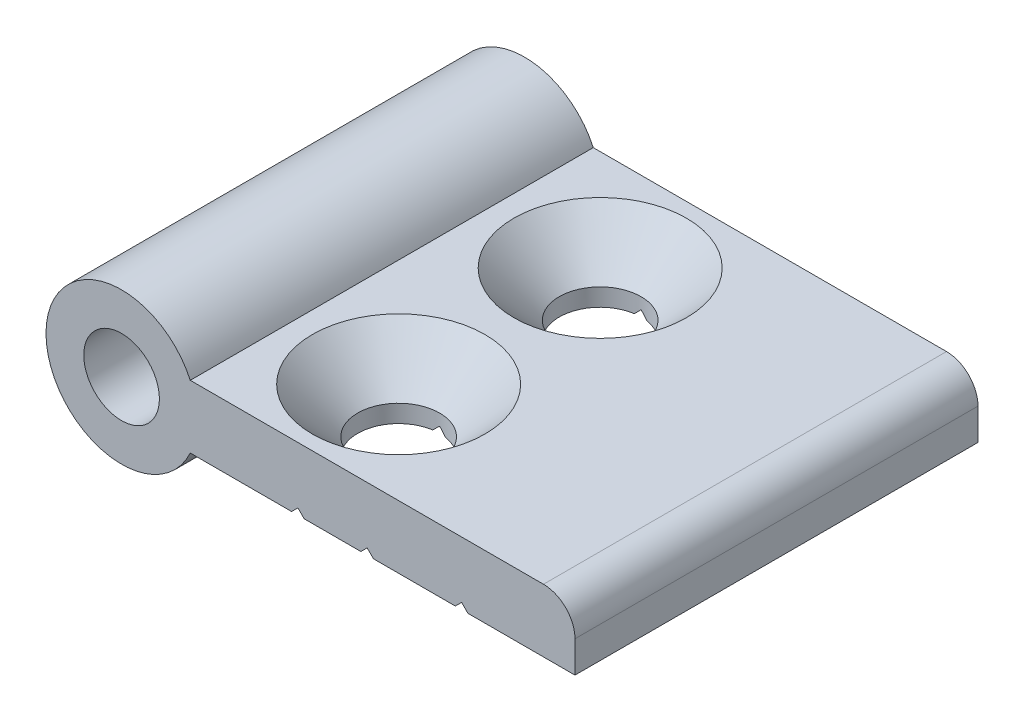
ISO-10303-21;
HEADER;
FILE_DESCRIPTION(('STEP AP214'),'2;1');
FILE_NAME('part.step','',(''),(''),'','','');
FILE_SCHEMA(('AUTOMOTIVE_DESIGN { 1 0 10303 214 1 1 1 1 }'));
ENDSEC;
DATA;
#1=APPLICATION_CONTEXT('core data for automotive mechanical design processes');
#2=APPLICATION_PROTOCOL_DEFINITION('international standard','automotive_design',2000,#1);
#3=PRODUCT_CONTEXT('',#1,'mechanical');
#4=PRODUCT('Part','Part','',(#3));
#5=PRODUCT_RELATED_PRODUCT_CATEGORY('part','',(#4));
#6=PRODUCT_DEFINITION_FORMATION('','',#4);
#7=PRODUCT_DEFINITION_CONTEXT('part definition',#1,'design');
#8=PRODUCT_DEFINITION('design','',#6,#7);
#9=PRODUCT_DEFINITION_SHAPE('','',#8);
#10=(LENGTH_UNIT() NAMED_UNIT(*) SI_UNIT(.MILLI.,.METRE.));
#11=(NAMED_UNIT(*) PLANE_ANGLE_UNIT() SI_UNIT($,.RADIAN.));
#12=(NAMED_UNIT(*) SI_UNIT($,.STERADIAN.) SOLID_ANGLE_UNIT());
#13=UNCERTAINTY_MEASURE_WITH_UNIT(LENGTH_MEASURE(1.E-05),#10,'distance_accuracy_value','');
#14=(GEOMETRIC_REPRESENTATION_CONTEXT(3) GLOBAL_UNCERTAINTY_ASSIGNED_CONTEXT((#13)) GLOBAL_UNIT_ASSIGNED_CONTEXT((#10,
#11,#12)) REPRESENTATION_CONTEXT('',''));
#15=CARTESIAN_POINT('',(0.,0.,0.));
#16=DIRECTION('',(0.,0.,1.));
#17=DIRECTION('',(1.,0.,0.));
#18=AXIS2_PLACEMENT_3D('',#15,#16,#17);
#19=CARTESIAN_POINT('',(14.,-2.,0.));
#20=DIRECTION('',(-0.707106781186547,-0.707106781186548,0.));
#21=DIRECTION('',(0.707106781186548,-0.707106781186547,0.));
#22=AXIS2_PLACEMENT_3D('',#19,#20,#21);
#23=PLANE('',#22);
#24=DIRECTION('',(0.707106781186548,-0.707106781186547,0.));
#25=VECTOR('',#24,1.);
#26=CARTESIAN_POINT('',(14.,-2.,-16.));
#27=LINE('',#26,#25);
#28=CARTESIAN_POINT('',(14.,-2.,-16.));
#29=VERTEX_POINT('',#28);
#30=CARTESIAN_POINT('',(14.5,-2.5,-16.));
#31=VERTEX_POINT('',#30);
#32=EDGE_CURVE('E133',#29,#31,#27,.T.);
#33=ORIENTED_EDGE('',*,*,#32,.T.);
#34=DIRECTION('',(0.,0.,-1.));
#35=VECTOR('',#34,1.);
#36=CARTESIAN_POINT('',(14.5,-2.5,0.));
#37=LINE('',#36,#35);
#38=CARTESIAN_POINT('',(14.5,-2.5,-11.2113081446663));
#39=VERTEX_POINT('',#38);
#40=EDGE_CURVE('E267',#39,#31,#37,.T.);
#41=ORIENTED_EDGE('',*,*,#40,.F.);
#42=CARTESIAN_POINT('',(14.,-2.,-8.));
#43=DIRECTION('',(-0.707106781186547,-0.707106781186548,0.));
#44=DIRECTION('',(0.707106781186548,-0.707106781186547,0.));
#45=AXIS2_PLACEMENT_3D('',#42,#43,#44);
#46=ELLIPSE('',#45,4.59619407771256,3.25);
#47=CARTESIAN_POINT('',(14.,-2.,-11.25));
#48=VERTEX_POINT('',#47);
#49=EDGE_CURVE('E149',#39,#48,#46,.F.);
#50=ORIENTED_EDGE('',*,*,#49,.T.);
#51=DIRECTION('',(0.,0.,1.));
#52=VECTOR('',#51,1.);
#53=CARTESIAN_POINT('',(14.,-2.,0.));
#54=LINE('',#53,#52);
#55=EDGE_CURVE('E148',#29,#48,#54,.T.);
#56=ORIENTED_EDGE('',*,*,#55,.F.);
#57=EDGE_LOOP('',(#33,#41,#50,#56));
#58=FACE_BOUND('',#57,.T.);
#59=ADVANCED_FACE('F16',(#58),#23,.T.);
#60=CARTESIAN_POINT('',(19.,-2.5,0.));
#61=DIRECTION('',(0.707106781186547,-0.707106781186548,0.));
#62=DIRECTION('',(0.707106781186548,0.707106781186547,0.));
#63=AXIS2_PLACEMENT_3D('',#60,#61,#62);
#64=PLANE('',#63);
#65=DIRECTION('',(0.707106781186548,0.707106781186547,0.));
#66=VECTOR('',#65,1.);
#67=CARTESIAN_POINT('',(19.,-2.5,16.));
#68=LINE('',#67,#66);
#69=CARTESIAN_POINT('',(19.5,-2.,16.));
#70=VERTEX_POINT('',#69);
#71=CARTESIAN_POINT('',(19.,-2.5,16.));
#72=VERTEX_POINT('',#71);
#73=EDGE_CURVE('E204',#70,#72,#68,.F.);
#74=ORIENTED_EDGE('',*,*,#73,.T.);
#75=DIRECTION('',(0.,0.,-1.));
#76=VECTOR('',#75,1.);
#77=CARTESIAN_POINT('',(19.,-2.5,0.));
#78=LINE('',#77,#76);
#79=CARTESIAN_POINT('',(19.,-2.5,-16.));
#80=VERTEX_POINT('',#79);
#81=EDGE_CURVE('E291',#80,#72,#78,.F.);
#82=ORIENTED_EDGE('',*,*,#81,.F.);
#83=DIRECTION('',(0.707106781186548,0.707106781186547,0.));
#84=VECTOR('',#83,1.);
#85=CARTESIAN_POINT('',(19.,-2.5,-16.));
#86=LINE('',#85,#84);
#87=CARTESIAN_POINT('',(19.5,-2.,-16.));
#88=VERTEX_POINT('',#87);
#89=EDGE_CURVE('E145',#80,#88,#86,.T.);
#90=ORIENTED_EDGE('',*,*,#89,.T.);
#91=DIRECTION('',(0.,0.,1.));
#92=VECTOR('',#91,1.);
#93=CARTESIAN_POINT('',(19.5,-2.,0.));
#94=LINE('',#93,#92);
#95=EDGE_CURVE('E192',#70,#88,#94,.F.);
#96=ORIENTED_EDGE('',*,*,#95,.F.);
#97=EDGE_LOOP('',(#74,#82,#90,#96));
#98=FACE_BOUND('',#97,.T.);
#99=ADVANCED_FACE('F431',(#98),#64,.T.);
#100=CARTESIAN_POINT('',(14.,-2.,0.));
#101=DIRECTION('',(-0.707106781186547,-0.707106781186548,0.));
#102=DIRECTION('',(0.707106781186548,-0.707106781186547,0.));
#103=AXIS2_PLACEMENT_3D('',#100,#101,#102);
#104=PLANE('',#103);
#105=DIRECTION('',(0.707106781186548,-0.707106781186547,0.));
#106=VECTOR('',#105,1.);
#107=CARTESIAN_POINT('',(14.,-2.,16.));
#108=LINE('',#107,#106);
#109=CARTESIAN_POINT('',(14.5,-2.5,16.));
#110=VERTEX_POINT('',#109);
#111=CARTESIAN_POINT('',(14.,-2.,16.));
#112=VERTEX_POINT('',#111);
#113=EDGE_CURVE('E201',#110,#112,#108,.F.);
#114=ORIENTED_EDGE('',*,*,#113,.T.);
#115=DIRECTION('',(0.,0.,1.));
#116=VECTOR('',#115,1.);
#117=CARTESIAN_POINT('',(14.,-2.,0.));
#118=LINE('',#117,#116);
#119=CARTESIAN_POINT('',(14.,-2.,11.25));
#120=VERTEX_POINT('',#119);
#121=EDGE_CURVE('E169',#120,#112,#118,.T.);
#122=ORIENTED_EDGE('',*,*,#121,.F.);
#123=CARTESIAN_POINT('',(14.,-2.,8.));
#124=DIRECTION('',(-0.707106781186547,-0.707106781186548,0.));
#125=DIRECTION('',(0.707106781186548,-0.707106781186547,0.));
#126=AXIS2_PLACEMENT_3D('',#123,#124,#125);
#127=ELLIPSE('',#126,4.59619407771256,3.25);
#128=CARTESIAN_POINT('',(14.5,-2.5,11.2113081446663));
#129=VERTEX_POINT('',#128);
#130=EDGE_CURVE('E179',#120,#129,#127,.F.);
#131=ORIENTED_EDGE('',*,*,#130,.T.);
#132=DIRECTION('',(0.,0.,-1.));
#133=VECTOR('',#132,1.);
#134=CARTESIAN_POINT('',(14.5,-2.5,0.));
#135=LINE('',#134,#133);
#136=EDGE_CURVE('E264',#110,#129,#135,.T.);
#137=ORIENTED_EDGE('',*,*,#136,.F.);
#138=EDGE_LOOP('',(#114,#122,#131,#137));
#139=FACE_BOUND('',#138,.T.);
#140=ADVANCED_FACE('F434',(#139),#104,.T.);
#141=CARTESIAN_POINT('',(14.,-2.,0.));
#142=DIRECTION('',(-0.707106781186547,-0.707106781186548,0.));
#143=DIRECTION('',(0.707106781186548,-0.707106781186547,0.));
#144=AXIS2_PLACEMENT_3D('',#141,#142,#143);
#145=PLANE('',#144);
#146=CARTESIAN_POINT('',(14.,-2.,8.));
#147=DIRECTION('',(-0.707106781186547,-0.707106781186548,0.));
#148=DIRECTION('',(0.707106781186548,-0.707106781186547,0.));
#149=AXIS2_PLACEMENT_3D('',#146,#147,#148);
#150=ELLIPSE('',#149,4.59619407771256,3.25);
#151=CARTESIAN_POINT('',(14.5,-2.5,4.78869185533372));
#152=VERTEX_POINT('',#151);
#153=CARTESIAN_POINT('',(14.,-2.,4.75));
#154=VERTEX_POINT('',#153);
#155=EDGE_CURVE('E273',#152,#154,#150,.F.);
#156=ORIENTED_EDGE('',*,*,#155,.T.);
#157=DIRECTION('',(0.,0.,1.));
#158=VECTOR('',#157,1.);
#159=CARTESIAN_POINT('',(14.,-2.,0.));
#160=LINE('',#159,#158);
#161=CARTESIAN_POINT('',(14.,-2.,-4.75));
#162=VERTEX_POINT('',#161);
#163=EDGE_CURVE('E176',#162,#154,#160,.T.);
#164=ORIENTED_EDGE('',*,*,#163,.F.);
#165=CARTESIAN_POINT('',(14.,-2.,-8.));
#166=DIRECTION('',(-0.707106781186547,-0.707106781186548,0.));
#167=DIRECTION('',(0.707106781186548,-0.707106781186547,0.));
#168=AXIS2_PLACEMENT_3D('',#165,#166,#167);
#169=ELLIPSE('',#168,4.59619407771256,3.25);
#170=CARTESIAN_POINT('',(14.5,-2.5,-4.78869185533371));
#171=VERTEX_POINT('',#170);
#172=EDGE_CURVE('E20',#162,#171,#169,.F.);
#173=ORIENTED_EDGE('',*,*,#172,.T.);
#174=DIRECTION('',(0.,0.,-1.));
#175=VECTOR('',#174,1.);
#176=CARTESIAN_POINT('',(14.5,-2.5,0.));
#177=LINE('',#176,#175);
#178=EDGE_CURVE('E223',#152,#171,#177,.T.);
#179=ORIENTED_EDGE('',*,*,#178,.F.);
#180=EDGE_LOOP('',(#156,#164,#173,#179));
#181=FACE_BOUND('',#180,.T.);
#182=ADVANCED_FACE('F279',(#181),#145,.T.);
#183=CARTESIAN_POINT('',(26.5,-2.5,0.));
#184=DIRECTION('',(0.707106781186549,-0.707106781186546,0.));
#185=DIRECTION('',(0.707106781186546,0.707106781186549,0.));
#186=AXIS2_PLACEMENT_3D('',#183,#184,#185);
#187=PLANE('',#186);
#188=DIRECTION('',(0.707106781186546,0.707106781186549,0.));
#189=VECTOR('',#188,1.);
#190=CARTESIAN_POINT('',(26.5,-2.5,16.));
#191=LINE('',#190,#189);
#192=CARTESIAN_POINT('',(27.,-2.,16.));
#193=VERTEX_POINT('',#192);
#194=CARTESIAN_POINT('',(26.5,-2.5,16.));
#195=VERTEX_POINT('',#194);
#196=EDGE_CURVE('E105',#193,#195,#191,.F.);
#197=ORIENTED_EDGE('',*,*,#196,.T.);
#198=DIRECTION('',(0.,0.,-1.));
#199=VECTOR('',#198,1.);
#200=CARTESIAN_POINT('',(26.5,-2.5,0.));
#201=LINE('',#200,#199);
#202=CARTESIAN_POINT('',(26.5,-2.5,-16.));
#203=VERTEX_POINT('',#202);
#204=EDGE_CURVE('E219',#203,#195,#201,.F.);
#205=ORIENTED_EDGE('',*,*,#204,.F.);
#206=DIRECTION('',(0.707106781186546,0.707106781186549,0.));
#207=VECTOR('',#206,1.);
#208=CARTESIAN_POINT('',(26.5,-2.5,-16.));
#209=LINE('',#208,#207);
#210=CARTESIAN_POINT('',(27.,-2.,-16.));
#211=VERTEX_POINT('',#210);
#212=EDGE_CURVE('E203',#203,#211,#209,.T.);
#213=ORIENTED_EDGE('',*,*,#212,.T.);
#214=DIRECTION('',(0.,0.,1.));
#215=VECTOR('',#214,1.);
#216=CARTESIAN_POINT('',(27.,-2.,0.));
#217=LINE('',#216,#215);
#218=EDGE_CURVE('E188',#193,#211,#217,.F.);
#219=ORIENTED_EDGE('',*,*,#218,.F.);
#220=EDGE_LOOP('',(#197,#205,#213,#219));
#221=FACE_BOUND('',#220,.T.);
#222=ADVANCED_FACE('F441',(#221),#187,.T.);
#223=CARTESIAN_POINT('',(19.5,-2.,0.));
#224=DIRECTION('',(-0.707106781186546,-0.707106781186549,0.));
#225=DIRECTION('',(0.707106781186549,-0.707106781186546,0.));
#226=AXIS2_PLACEMENT_3D('',#223,#224,#225);
#227=PLANE('',#226);
#228=DIRECTION('',(0.707106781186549,-0.707106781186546,0.));
#229=VECTOR('',#228,1.);
#230=CARTESIAN_POINT('',(19.5,-2.,16.));
#231=LINE('',#230,#229);
#232=CARTESIAN_POINT('',(20.,-2.5,16.));
#233=VERTEX_POINT('',#232);
#234=EDGE_CURVE('E195',#233,#70,#231,.F.);
#235=ORIENTED_EDGE('',*,*,#234,.T.);
#236=ORIENTED_EDGE('',*,*,#95,.T.);
#237=DIRECTION('',(0.707106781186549,-0.707106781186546,0.));
#238=VECTOR('',#237,1.);
#239=CARTESIAN_POINT('',(19.5,-2.,-16.));
#240=LINE('',#239,#238);
#241=CARTESIAN_POINT('',(20.,-2.5,-16.));
#242=VERTEX_POINT('',#241);
#243=EDGE_CURVE('E198',#88,#242,#240,.T.);
#244=ORIENTED_EDGE('',*,*,#243,.T.);
#245=DIRECTION('',(0.,0.,-1.));
#246=VECTOR('',#245,1.);
#247=CARTESIAN_POINT('',(20.,-2.5,0.));
#248=LINE('',#247,#246);
#249=EDGE_CURVE('E222',#233,#242,#248,.T.);
#250=ORIENTED_EDGE('',*,*,#249,.F.);
#251=EDGE_LOOP('',(#235,#236,#244,#250));
#252=FACE_BOUND('',#251,.T.);
#253=ADVANCED_FACE('F444',(#252),#227,.T.);
#254=CARTESIAN_POINT('',(27.,-2.,0.));
#255=DIRECTION('',(-0.707106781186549,-0.707106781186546,0.));
#256=DIRECTION('',(0.707106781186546,-0.707106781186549,0.));
#257=AXIS2_PLACEMENT_3D('',#254,#255,#256);
#258=PLANE('',#257);
#259=DIRECTION('',(0.707106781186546,-0.707106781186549,0.));
#260=VECTOR('',#259,1.);
#261=CARTESIAN_POINT('',(27.,-2.,16.));
#262=LINE('',#261,#260);
#263=CARTESIAN_POINT('',(27.5,-2.5,16.));
#264=VERTEX_POINT('',#263);
#265=EDGE_CURVE('E185',#264,#193,#262,.F.);
#266=ORIENTED_EDGE('',*,*,#265,.T.);
#267=ORIENTED_EDGE('',*,*,#218,.T.);
#268=DIRECTION('',(0.707106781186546,-0.707106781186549,0.));
#269=VECTOR('',#268,1.);
#270=CARTESIAN_POINT('',(27.,-2.,-16.));
#271=LINE('',#270,#269);
#272=CARTESIAN_POINT('',(27.5,-2.5,-16.));
#273=VERTEX_POINT('',#272);
#274=EDGE_CURVE('E189',#211,#273,#271,.T.);
#275=ORIENTED_EDGE('',*,*,#274,.T.);
#276=DIRECTION('',(0.,0.,-1.));
#277=VECTOR('',#276,1.);
#278=CARTESIAN_POINT('',(27.5,-2.5,0.));
#279=LINE('',#278,#277);
#280=EDGE_CURVE('E314',#264,#273,#279,.T.);
#281=ORIENTED_EDGE('',*,*,#280,.F.);
#282=EDGE_LOOP('',(#266,#267,#275,#281));
#283=FACE_BOUND('',#282,.T.);
#284=ADVANCED_FACE('F313',(#283),#258,.T.);
#285=CARTESIAN_POINT('',(14.,-1.09999999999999,-8.));
#286=DIRECTION('',(0.,-1.,0.));
#287=DIRECTION('',(0.,0.,-1.));
#288=AXIS2_PLACEMENT_3D('',#285,#286,#287);
#289=CYLINDRICAL_SURFACE('',#288,3.25);
#290=CARTESIAN_POINT('',(14.,-1.1,-8.));
#291=DIRECTION('',(0.,1.,0.));
#292=DIRECTION('',(0.,0.,1.));
#293=AXIS2_PLACEMENT_3D('',#290,#291,#292);
#294=CIRCLE('',#293,3.25);
#295=CARTESIAN_POINT('',(14.,-1.1,-4.75));
#296=VERTEX_POINT('',#295);
#297=EDGE_CURVE('E165',#296,#296,#294,.T.);
#298=ORIENTED_EDGE('',*,*,#297,.T.);
#299=EDGE_LOOP('',(#298));
#300=FACE_BOUND('',#299,.T.);
#301=CARTESIAN_POINT('',(14.,-2.,-8.));
#302=DIRECTION('',(0.707106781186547,-0.707106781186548,0.));
#303=DIRECTION('',(-0.707106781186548,-0.707106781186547,0.));
#304=AXIS2_PLACEMENT_3D('',#301,#302,#303);
#305=ELLIPSE('',#304,4.59619407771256,3.25);
#306=CARTESIAN_POINT('',(13.5,-2.5,-11.2113081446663));
#307=VERTEX_POINT('',#306);
#308=EDGE_CURVE('E154',#48,#307,#305,.F.);
#309=ORIENTED_EDGE('',*,*,#308,.F.);
#310=ORIENTED_EDGE('',*,*,#49,.F.);
#311=CARTESIAN_POINT('',(14.,-2.5,-8.));
#312=DIRECTION('',(0.,-1.,0.));
#313=DIRECTION('',(0.,0.,-1.));
#314=AXIS2_PLACEMENT_3D('',#311,#312,#313);
#315=CIRCLE('',#314,3.25);
#316=EDGE_CURVE('E153',#171,#39,#315,.F.);
#317=ORIENTED_EDGE('',*,*,#316,.F.);
#318=ORIENTED_EDGE('',*,*,#172,.F.);
#319=CARTESIAN_POINT('',(14.,-2.,-8.));
#320=DIRECTION('',(0.707106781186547,-0.707106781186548,0.));
#321=DIRECTION('',(-0.707106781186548,-0.707106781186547,0.));
#322=AXIS2_PLACEMENT_3D('',#319,#320,#321);
#323=ELLIPSE('',#322,4.59619407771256,3.25);
#324=CARTESIAN_POINT('',(13.5,-2.5,-4.78869185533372));
#325=VERTEX_POINT('',#324);
#326=EDGE_CURVE('E180',#325,#162,#323,.F.);
#327=ORIENTED_EDGE('',*,*,#326,.F.);
#328=CARTESIAN_POINT('',(14.,-2.5,-8.));
#329=DIRECTION('',(0.,-1.,0.));
#330=DIRECTION('',(0.,0.,-1.));
#331=AXIS2_PLACEMENT_3D('',#328,#329,#330);
#332=CIRCLE('',#331,3.25);
#333=EDGE_CURVE('E253',#307,#325,#332,.F.);
#334=ORIENTED_EDGE('',*,*,#333,.F.);
#335=EDGE_LOOP('',(#309,#310,#317,#318,#327,#334));
#336=FACE_BOUND('',#335,.T.);
#337=ADVANCED_FACE('F281',(#300,#336),#289,.F.);
#338=CARTESIAN_POINT('',(13.5,-2.5,0.));
#339=DIRECTION('',(0.707106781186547,-0.707106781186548,0.));
#340=DIRECTION('',(0.707106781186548,0.707106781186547,0.));
#341=AXIS2_PLACEMENT_3D('',#338,#339,#340);
#342=PLANE('',#341);
#343=CARTESIAN_POINT('',(14.,-2.,8.));
#344=DIRECTION('',(0.707106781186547,-0.707106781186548,0.));
#345=DIRECTION('',(-0.707106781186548,-0.707106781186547,0.));
#346=AXIS2_PLACEMENT_3D('',#343,#344,#345);
#347=ELLIPSE('',#346,4.59619407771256,3.25);
#348=CARTESIAN_POINT('',(13.5,-2.5,4.78869185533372));
#349=VERTEX_POINT('',#348);
#350=EDGE_CURVE('E271',#154,#349,#347,.F.);
#351=ORIENTED_EDGE('',*,*,#350,.T.);
#352=DIRECTION('',(0.,0.,-1.));
#353=VECTOR('',#352,1.);
#354=CARTESIAN_POINT('',(13.5,-2.5,0.));
#355=LINE('',#354,#353);
#356=EDGE_CURVE('E252',#325,#349,#355,.F.);
#357=ORIENTED_EDGE('',*,*,#356,.F.);
#358=ORIENTED_EDGE('',*,*,#326,.T.);
#359=ORIENTED_EDGE('',*,*,#163,.T.);
#360=EDGE_LOOP('',(#351,#357,#358,#359));
#361=FACE_BOUND('',#360,.T.);
#362=ADVANCED_FACE('F362',(#361),#342,.T.);
#363=CARTESIAN_POINT('',(14.,-1.09999999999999,8.));
#364=DIRECTION('',(0.,-1.,0.));
#365=DIRECTION('',(0.,0.,-1.));
#366=AXIS2_PLACEMENT_3D('',#363,#364,#365);
#367=CYLINDRICAL_SURFACE('',#366,3.25);
#368=CARTESIAN_POINT('',(14.,-1.1,8.));
#369=DIRECTION('',(0.,1.,0.));
#370=DIRECTION('',(0.,0.,1.));
#371=AXIS2_PLACEMENT_3D('',#368,#369,#370);
#372=CIRCLE('',#371,3.25);
#373=CARTESIAN_POINT('',(14.,-1.1,11.25));
#374=VERTEX_POINT('',#373);
#375=EDGE_CURVE('E160',#374,#374,#372,.T.);
#376=ORIENTED_EDGE('',*,*,#375,.T.);
#377=EDGE_LOOP('',(#376));
#378=FACE_BOUND('',#377,.T.);
#379=ORIENTED_EDGE('',*,*,#350,.F.);
#380=ORIENTED_EDGE('',*,*,#155,.F.);
#381=CARTESIAN_POINT('',(14.,-2.5,8.));
#382=DIRECTION('',(0.,-1.,0.));
#383=DIRECTION('',(0.,0.,-1.));
#384=AXIS2_PLACEMENT_3D('',#381,#382,#383);
#385=CIRCLE('',#384,3.25);
#386=EDGE_CURVE('E261',#129,#152,#385,.F.);
#387=ORIENTED_EDGE('',*,*,#386,.F.);
#388=ORIENTED_EDGE('',*,*,#130,.F.);
#389=CARTESIAN_POINT('',(14.,-2.,8.));
#390=DIRECTION('',(0.707106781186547,-0.707106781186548,0.));
#391=DIRECTION('',(-0.707106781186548,-0.707106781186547,0.));
#392=AXIS2_PLACEMENT_3D('',#389,#390,#391);
#393=ELLIPSE('',#392,4.59619407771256,3.25);
#394=CARTESIAN_POINT('',(13.5,-2.5,11.2113081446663));
#395=VERTEX_POINT('',#394);
#396=EDGE_CURVE('E173',#395,#120,#393,.F.);
#397=ORIENTED_EDGE('',*,*,#396,.F.);
#398=CARTESIAN_POINT('',(14.,-2.5,8.));
#399=DIRECTION('',(0.,-1.,0.));
#400=DIRECTION('',(0.,0.,-1.));
#401=AXIS2_PLACEMENT_3D('',#398,#399,#400);
#402=CIRCLE('',#401,3.25);
#403=EDGE_CURVE('E248',#349,#395,#402,.F.);
#404=ORIENTED_EDGE('',*,*,#403,.F.);
#405=EDGE_LOOP('',(#379,#380,#387,#388,#397,#404));
#406=FACE_BOUND('',#405,.T.);
#407=ADVANCED_FACE('F365',(#378,#406),#367,.F.);
#408=CARTESIAN_POINT('',(13.5,-2.5,0.));
#409=DIRECTION('',(0.707106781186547,-0.707106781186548,0.));
#410=DIRECTION('',(0.707106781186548,0.707106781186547,0.));
#411=AXIS2_PLACEMENT_3D('',#408,#409,#410);
#412=PLANE('',#411);
#413=DIRECTION('',(0.707106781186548,0.707106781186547,0.));
#414=VECTOR('',#413,1.);
#415=CARTESIAN_POINT('',(13.5,-2.5,16.));
#416=LINE('',#415,#414);
#417=CARTESIAN_POINT('',(13.5,-2.5,16.));
#418=VERTEX_POINT('',#417);
#419=EDGE_CURVE('E172',#112,#418,#416,.F.);
#420=ORIENTED_EDGE('',*,*,#419,.T.);
#421=DIRECTION('',(0.,0.,-1.));
#422=VECTOR('',#421,1.);
#423=CARTESIAN_POINT('',(13.5,-2.5,0.));
#424=LINE('',#423,#422);
#425=EDGE_CURVE('E251',#395,#418,#424,.F.);
#426=ORIENTED_EDGE('',*,*,#425,.F.);
#427=ORIENTED_EDGE('',*,*,#396,.T.);
#428=ORIENTED_EDGE('',*,*,#121,.T.);
#429=EDGE_LOOP('',(#420,#426,#427,#428));
#430=FACE_BOUND('',#429,.T.);
#431=ADVANCED_FACE('F369',(#430),#412,.T.);
#432=CARTESIAN_POINT('',(13.5,-2.5,0.));
#433=DIRECTION('',(0.707106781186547,-0.707106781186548,0.));
#434=DIRECTION('',(0.707106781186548,0.707106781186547,0.));
#435=AXIS2_PLACEMENT_3D('',#432,#433,#434);
#436=PLANE('',#435);
#437=DIRECTION('',(0.707106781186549,0.707106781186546,0.));
#438=VECTOR('',#437,1.);
#439=CARTESIAN_POINT('',(13.5,-2.5,-16.));
#440=LINE('',#439,#438);
#441=CARTESIAN_POINT('',(13.5,-2.5,-16.));
#442=VERTEX_POINT('',#441);
#443=EDGE_CURVE('E137',#442,#29,#440,.T.);
#444=ORIENTED_EDGE('',*,*,#443,.T.);
#445=ORIENTED_EDGE('',*,*,#55,.T.);
#446=ORIENTED_EDGE('',*,*,#308,.T.);
#447=DIRECTION('',(0.,0.,-1.));
#448=VECTOR('',#447,1.);
#449=CARTESIAN_POINT('',(13.5,-2.5,0.));
#450=LINE('',#449,#448);
#451=EDGE_CURVE('E158',#442,#307,#450,.F.);
#452=ORIENTED_EDGE('',*,*,#451,.F.);
#453=EDGE_LOOP('',(#444,#445,#446,#452));
#454=FACE_BOUND('',#453,.T.);
#455=ADVANCED_FACE('F156',(#454),#436,.T.);
#456=CARTESIAN_POINT('',(14.5,-2.5,0.));
#457=DIRECTION('',(0.,-1.,0.));
#458=DIRECTION('',(0.,0.,-1.));
#459=AXIS2_PLACEMENT_3D('',#456,#457,#458);
#460=PLANE('',#459);
#461=ORIENTED_EDGE('',*,*,#386,.T.);
#462=ORIENTED_EDGE('',*,*,#178,.T.);
#463=ORIENTED_EDGE('',*,*,#316,.T.);
#464=ORIENTED_EDGE('',*,*,#40,.T.);
#465=DIRECTION('',(1.,0.,0.));
#466=VECTOR('',#465,1.);
#467=CARTESIAN_POINT('',(14.3886766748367,-2.5,-16.));
#468=LINE('',#467,#466);
#469=EDGE_CURVE('E141',#31,#80,#468,.T.);
#470=ORIENTED_EDGE('',*,*,#469,.T.);
#471=ORIENTED_EDGE('',*,*,#81,.T.);
#472=DIRECTION('',(1.,0.,0.));
#473=VECTOR('',#472,1.);
#474=CARTESIAN_POINT('',(14.3886766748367,-2.5,16.));
#475=LINE('',#474,#473);
#476=EDGE_CURVE('E205',#110,#72,#475,.T.);
#477=ORIENTED_EDGE('',*,*,#476,.F.);
#478=ORIENTED_EDGE('',*,*,#136,.T.);
#479=EDGE_LOOP('',(#461,#462,#463,#464,#470,#471,#477,#478));
#480=FACE_BOUND('',#479,.T.);
#481=ADVANCED_FACE('F283',(#480),#460,.T.);
#482=CARTESIAN_POINT('',(20.,-2.5,0.));
#483=DIRECTION('',(0.,-1.,0.));
#484=DIRECTION('',(0.,0.,-1.));
#485=AXIS2_PLACEMENT_3D('',#482,#483,#484);
#486=PLANE('',#485);
#487=DIRECTION('',(1.,0.,0.));
#488=VECTOR('',#487,1.);
#489=CARTESIAN_POINT('',(14.3886766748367,-2.5,16.));
#490=LINE('',#489,#488);
#491=EDGE_CURVE('E208',#233,#195,#490,.T.);
#492=ORIENTED_EDGE('',*,*,#491,.F.);
#493=ORIENTED_EDGE('',*,*,#249,.T.);
#494=DIRECTION('',(1.,0.,0.));
#495=VECTOR('',#494,1.);
#496=CARTESIAN_POINT('',(14.3886766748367,-2.5,-16.));
#497=LINE('',#496,#495);
#498=EDGE_CURVE('E162',#242,#203,#497,.T.);
#499=ORIENTED_EDGE('',*,*,#498,.T.);
#500=ORIENTED_EDGE('',*,*,#204,.T.);
#501=EDGE_LOOP('',(#492,#493,#499,#500));
#502=FACE_BOUND('',#501,.T.);
#503=ADVANCED_FACE('F392',(#502),#486,.T.);
#504=CARTESIAN_POINT('',(27.5,-2.5,0.));
#505=DIRECTION('',(0.,-1.,0.));
#506=DIRECTION('',(0.,0.,-1.));
#507=AXIS2_PLACEMENT_3D('',#504,#505,#506);
#508=PLANE('',#507);
#509=DIRECTION('',(1.,0.,0.));
#510=VECTOR('',#509,1.);
#511=CARTESIAN_POINT('',(14.3886766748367,-2.5,16.));
#512=LINE('',#511,#510);
#513=CARTESIAN_POINT('',(36.,-2.5,16.));
#514=VERTEX_POINT('',#513);
#515=EDGE_CURVE('E225',#264,#514,#512,.T.);
#516=ORIENTED_EDGE('',*,*,#515,.F.);
#517=ORIENTED_EDGE('',*,*,#280,.T.);
#518=DIRECTION('',(1.,0.,0.));
#519=VECTOR('',#518,1.);
#520=CARTESIAN_POINT('',(14.3886766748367,-2.5,-16.));
#521=LINE('',#520,#519);
#522=CARTESIAN_POINT('',(36.,-2.5,-16.));
#523=VERTEX_POINT('',#522);
#524=EDGE_CURVE('E181',#273,#523,#521,.T.);
#525=ORIENTED_EDGE('',*,*,#524,.T.);
#526=DIRECTION('',(0.,0.,-1.));
#527=VECTOR('',#526,1.);
#528=CARTESIAN_POINT('',(36.,-2.5,0.));
#529=LINE('',#528,#527);
#530=EDGE_CURVE('E321',#514,#523,#529,.T.);
#531=ORIENTED_EDGE('',*,*,#530,.F.);
#532=EDGE_LOOP('',(#516,#517,#525,#531));
#533=FACE_BOUND('',#532,.T.);
#534=ADVANCED_FACE('F318',(#533),#508,.T.);
#535=CARTESIAN_POINT('',(36.,-2.5,0.));
#536=DIRECTION('',(1.,0.,0.));
#537=DIRECTION('',(0.,0.,-1.));
#538=AXIS2_PLACEMENT_3D('',#535,#536,#537);
#539=PLANE('',#538);
#540=DIRECTION('',(0.,1.,0.));
#541=VECTOR('',#540,1.);
#542=CARTESIAN_POINT('',(36.,-0.053688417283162,16.));
#543=LINE('',#542,#541);
#544=CARTESIAN_POINT('',(36.,0.,16.));
#545=VERTEX_POINT('',#544);
#546=EDGE_CURVE('E247',#514,#545,#543,.T.);
#547=ORIENTED_EDGE('',*,*,#546,.F.);
#548=ORIENTED_EDGE('',*,*,#530,.T.);
#549=DIRECTION('',(0.,1.,0.));
#550=VECTOR('',#549,1.);
#551=CARTESIAN_POINT('',(36.,-0.053688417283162,-16.));
#552=LINE('',#551,#550);
#553=CARTESIAN_POINT('',(36.,0.,-16.));
#554=VERTEX_POINT('',#553);
#555=EDGE_CURVE('E184',#523,#554,#552,.T.);
#556=ORIENTED_EDGE('',*,*,#555,.T.);
#557=DIRECTION('',(0.,0.,-1.));
#558=VECTOR('',#557,1.);
#559=CARTESIAN_POINT('',(36.,0.,0.));
#560=LINE('',#559,#558);
#561=EDGE_CURVE('E338',#545,#554,#560,.T.);
#562=ORIENTED_EDGE('',*,*,#561,.F.);
#563=EDGE_LOOP('',(#547,#548,#556,#562));
#564=FACE_BOUND('',#563,.T.);
#565=ADVANCED_FACE('F381',(#564),#539,.T.);
#566=CARTESIAN_POINT('',(0.,0.,0.));
#567=DIRECTION('',(0.,0.,-1.));
#568=DIRECTION('',(-1.,0.,0.));
#569=AXIS2_PLACEMENT_3D('',#566,#567,#568);
#570=CYLINDRICAL_SURFACE('',#569,3.);
#571=CARTESIAN_POINT('',(0.,0.,-16.));
#572=DIRECTION('',(0.,0.,-1.));
#573=DIRECTION('',(-1.,0.,0.));
#574=AXIS2_PLACEMENT_3D('',#571,#572,#573);
#575=CIRCLE('',#574,3.);
#576=CARTESIAN_POINT('',(-3.,0.,-16.));
#577=VERTEX_POINT('',#576);
#578=EDGE_CURVE('E256',#577,#577,#575,.T.);
#579=ORIENTED_EDGE('',*,*,#578,.T.);
#580=EDGE_LOOP('',(#579));
#581=FACE_BOUND('',#580,.T.);
#582=CARTESIAN_POINT('',(0.,0.,16.));
#583=DIRECTION('',(0.,0.,-1.));
#584=DIRECTION('',(-1.,0.,0.));
#585=AXIS2_PLACEMENT_3D('',#582,#583,#584);
#586=CIRCLE('',#585,3.);
#587=CARTESIAN_POINT('',(-3.,0.,16.));
#588=VERTEX_POINT('',#587);
#589=EDGE_CURVE('E241',#588,#588,#586,.T.);
#590=ORIENTED_EDGE('',*,*,#589,.F.);
#591=EDGE_LOOP('',(#590));
#592=FACE_BOUND('',#591,.T.);
#593=ADVANCED_FACE('F383',(#581,#592),#570,.F.);
#594=CARTESIAN_POINT('',(33.5,0.,0.));
#595=DIRECTION('',(0.,0.,-1.));
#596=DIRECTION('',(-1.,0.,0.));
#597=AXIS2_PLACEMENT_3D('',#594,#595,#596);
#598=CYLINDRICAL_SURFACE('',#597,2.5);
#599=CARTESIAN_POINT('',(33.5,0.,16.));
#600=DIRECTION('',(0.,0.,-1.));
#601=DIRECTION('',(-1.,0.,0.));
#602=AXIS2_PLACEMENT_3D('',#599,#600,#601);
#603=CIRCLE('',#602,2.5);
#604=CARTESIAN_POINT('',(33.5,2.5,16.));
#605=VERTEX_POINT('',#604);
#606=EDGE_CURVE('E245',#545,#605,#603,.F.);
#607=ORIENTED_EDGE('',*,*,#606,.F.);
#608=ORIENTED_EDGE('',*,*,#561,.T.);
#609=CARTESIAN_POINT('',(33.5,0.,-16.));
#610=DIRECTION('',(0.,0.,-1.));
#611=DIRECTION('',(-1.,0.,0.));
#612=AXIS2_PLACEMENT_3D('',#609,#610,#611);
#613=CIRCLE('',#612,2.5);
#614=CARTESIAN_POINT('',(33.5,2.5,-16.));
#615=VERTEX_POINT('',#614);
#616=EDGE_CURVE('E259',#554,#615,#613,.F.);
#617=ORIENTED_EDGE('',*,*,#616,.T.);
#618=DIRECTION('',(0.,0.,1.));
#619=VECTOR('',#618,1.);
#620=CARTESIAN_POINT('',(33.5,2.5,0.));
#621=LINE('',#620,#619);
#622=EDGE_CURVE('E240',#605,#615,#621,.F.);
#623=ORIENTED_EDGE('',*,*,#622,.F.);
#624=EDGE_LOOP('',(#607,#608,#617,#623));
#625=FACE_BOUND('',#624,.T.);
#626=ADVANCED_FACE('F380',(#625),#598,.T.);
#627=CARTESIAN_POINT('',(14.,2.5,-8.));
#628=DIRECTION('',(0.,1.,0.));
#629=DIRECTION('',(0.,0.,1.));
#630=AXIS2_PLACEMENT_3D('',#627,#628,#629);
#631=CONICAL_SURFACE('',#630,6.85,0.785398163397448);
#632=ORIENTED_EDGE('',*,*,#297,.F.);
#633=EDGE_LOOP('',(#632));
#634=FACE_BOUND('',#633,.T.);
#635=CARTESIAN_POINT('',(14.,2.5,-8.));
#636=DIRECTION('',(0.,1.,0.));
#637=DIRECTION('',(0.,0.,1.));
#638=AXIS2_PLACEMENT_3D('',#635,#636,#637);
#639=CIRCLE('',#638,6.85);
#640=CARTESIAN_POINT('',(14.,2.5,-1.15));
#641=VERTEX_POINT('',#640);
#642=EDGE_CURVE('E237',#641,#641,#639,.F.);
#643=ORIENTED_EDGE('',*,*,#642,.F.);
#644=EDGE_LOOP('',(#643));
#645=FACE_BOUND('',#644,.T.);
#646=ADVANCED_FACE('F411',(#634,#645),#631,.F.);
#647=CARTESIAN_POINT('',(14.,2.5,8.));
#648=DIRECTION('',(0.,1.,0.));
#649=DIRECTION('',(-1.,0.,0.));
#650=AXIS2_PLACEMENT_3D('',#647,#648,#649);
#651=CONICAL_SURFACE('',#650,6.85,0.785398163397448);
#652=ORIENTED_EDGE('',*,*,#375,.F.);
#653=EDGE_LOOP('',(#652));
#654=FACE_BOUND('',#653,.T.);
#655=CARTESIAN_POINT('',(14.,2.5,8.));
#656=DIRECTION('',(0.,1.,0.));
#657=DIRECTION('',(-1.,0.,0.));
#658=AXIS2_PLACEMENT_3D('',#655,#656,#657);
#659=CIRCLE('',#658,6.85);
#660=CARTESIAN_POINT('',(7.15000000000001,2.5,8.));
#661=VERTEX_POINT('',#660);
#662=EDGE_CURVE('E234',#661,#661,#659,.F.);
#663=ORIENTED_EDGE('',*,*,#662,.F.);
#664=EDGE_LOOP('',(#663));
#665=FACE_BOUND('',#664,.T.);
#666=ADVANCED_FACE('F18',(#654,#665),#651,.F.);
#667=CARTESIAN_POINT('',(14.3886766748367,-0.053688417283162,-16.));
#668=DIRECTION('',(0.,0.,1.));
#669=DIRECTION('',(1.,0.,0.));
#670=AXIS2_PLACEMENT_3D('',#667,#668,#669);
#671=PLANE('',#670);
#672=ORIENTED_EDGE('',*,*,#578,.F.);
#673=EDGE_LOOP('',(#672));
#674=FACE_BOUND('',#673,.T.);
#675=CARTESIAN_POINT('',(0.,0.,-16.));
#676=DIRECTION('',(0.,0.,-1.));
#677=DIRECTION('',(-1.,0.,0.));
#678=AXIS2_PLACEMENT_3D('',#675,#676,#677);
#679=CIRCLE('',#678,6.);
#680=CARTESIAN_POINT('',(5.45435605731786,2.5,-16.));
#681=VERTEX_POINT('',#680);
#682=CARTESIAN_POINT('',(5.45435605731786,-2.5,-16.));
#683=VERTEX_POINT('',#682);
#684=EDGE_CURVE('E231',#681,#683,#679,.F.);
#685=ORIENTED_EDGE('',*,*,#684,.F.);
#686=DIRECTION('',(1.,0.,0.));
#687=VECTOR('',#686,1.);
#688=CARTESIAN_POINT('',(33.5,2.5,-16.));
#689=LINE('',#688,#687);
#690=EDGE_CURVE('E244',#615,#681,#689,.F.);
#691=ORIENTED_EDGE('',*,*,#690,.F.);
#692=ORIENTED_EDGE('',*,*,#616,.F.);
#693=ORIENTED_EDGE('',*,*,#555,.F.);
#694=ORIENTED_EDGE('',*,*,#524,.F.);
#695=ORIENTED_EDGE('',*,*,#274,.F.);
#696=ORIENTED_EDGE('',*,*,#212,.F.);
#697=ORIENTED_EDGE('',*,*,#498,.F.);
#698=ORIENTED_EDGE('',*,*,#243,.F.);
#699=ORIENTED_EDGE('',*,*,#89,.F.);
#700=ORIENTED_EDGE('',*,*,#469,.F.);
#701=ORIENTED_EDGE('',*,*,#32,.F.);
#702=ORIENTED_EDGE('',*,*,#443,.F.);
#703=DIRECTION('',(1.,0.,0.));
#704=VECTOR('',#703,1.);
#705=CARTESIAN_POINT('',(5.45435605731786,-2.5,-16.));
#706=LINE('',#705,#704);
#707=EDGE_CURVE('E330',#683,#442,#706,.T.);
#708=ORIENTED_EDGE('',*,*,#707,.F.);
#709=EDGE_LOOP('',(#685,#691,#692,#693,#694,#695,#696,#697,#698,#699,#700,#701,#702,#708));
#710=FACE_BOUND('',#709,.T.);
#711=ADVANCED_FACE('F135',(#674,#710),#671,.F.);
#712=CARTESIAN_POINT('',(5.45435605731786,-2.5,0.));
#713=DIRECTION('',(0.,-1.,0.));
#714=DIRECTION('',(0.,0.,-1.));
#715=AXIS2_PLACEMENT_3D('',#712,#713,#714);
#716=PLANE('',#715);
#717=ORIENTED_EDGE('',*,*,#707,.T.);
#718=ORIENTED_EDGE('',*,*,#451,.T.);
#719=ORIENTED_EDGE('',*,*,#333,.T.);
#720=ORIENTED_EDGE('',*,*,#356,.T.);
#721=ORIENTED_EDGE('',*,*,#403,.T.);
#722=ORIENTED_EDGE('',*,*,#425,.T.);
#723=DIRECTION('',(1.,0.,0.));
#724=VECTOR('',#723,1.);
#725=CARTESIAN_POINT('',(14.3886766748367,-2.5,16.));
#726=LINE('',#725,#724);
#727=CARTESIAN_POINT('',(5.45435605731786,-2.5,16.));
#728=VERTEX_POINT('',#727);
#729=EDGE_CURVE('E209',#728,#418,#726,.T.);
#730=ORIENTED_EDGE('',*,*,#729,.F.);
#731=DIRECTION('',(0.,0.,-1.));
#732=VECTOR('',#731,1.);
#733=CARTESIAN_POINT('',(5.45435605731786,-2.5,0.));
#734=LINE('',#733,#732);
#735=EDGE_CURVE('E230',#683,#728,#734,.F.);
#736=ORIENTED_EDGE('',*,*,#735,.F.);
#737=EDGE_LOOP('',(#717,#718,#719,#720,#721,#722,#730,#736));
#738=FACE_BOUND('',#737,.T.);
#739=ADVANCED_FACE('F359',(#738),#716,.T.);
#740=CARTESIAN_POINT('',(14.3886766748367,-0.053688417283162,16.));
#741=DIRECTION('',(0.,0.,1.));
#742=DIRECTION('',(1.,0.,0.));
#743=AXIS2_PLACEMENT_3D('',#740,#741,#742);
#744=PLANE('',#743);
#745=ORIENTED_EDGE('',*,*,#589,.T.);
#746=EDGE_LOOP('',(#745));
#747=FACE_BOUND('',#746,.T.);
#748=ORIENTED_EDGE('',*,*,#546,.T.);
#749=ORIENTED_EDGE('',*,*,#606,.T.);
#750=DIRECTION('',(1.,0.,0.));
#751=VECTOR('',#750,1.);
#752=CARTESIAN_POINT('',(33.5,2.5,16.));
#753=LINE('',#752,#751);
#754=CARTESIAN_POINT('',(5.45435605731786,2.5,16.));
#755=VERTEX_POINT('',#754);
#756=EDGE_CURVE('E35',#755,#605,#753,.T.);
#757=ORIENTED_EDGE('',*,*,#756,.F.);
#758=CARTESIAN_POINT('',(0.,0.,16.));
#759=DIRECTION('',(0.,0.,-1.));
#760=DIRECTION('',(-1.,0.,0.));
#761=AXIS2_PLACEMENT_3D('',#758,#759,#760);
#762=CIRCLE('',#761,6.);
#763=EDGE_CURVE('E26',#728,#755,#762,.T.);
#764=ORIENTED_EDGE('',*,*,#763,.F.);
#765=ORIENTED_EDGE('',*,*,#729,.T.);
#766=ORIENTED_EDGE('',*,*,#419,.F.);
#767=ORIENTED_EDGE('',*,*,#113,.F.);
#768=ORIENTED_EDGE('',*,*,#476,.T.);
#769=ORIENTED_EDGE('',*,*,#73,.F.);
#770=ORIENTED_EDGE('',*,*,#234,.F.);
#771=ORIENTED_EDGE('',*,*,#491,.T.);
#772=ORIENTED_EDGE('',*,*,#196,.F.);
#773=ORIENTED_EDGE('',*,*,#265,.F.);
#774=ORIENTED_EDGE('',*,*,#515,.T.);
#775=EDGE_LOOP('',(#748,#749,#757,#764,#765,#766,#767,#768,#769,#770,#771,#772,#773,#774));
#776=FACE_BOUND('',#775,.T.);
#777=ADVANCED_FACE('F372',(#747,#776),#744,.T.);
#778=CARTESIAN_POINT('',(33.5,2.5,0.));
#779=DIRECTION('',(0.,1.,0.));
#780=DIRECTION('',(0.,0.,1.));
#781=AXIS2_PLACEMENT_3D('',#778,#779,#780);
#782=PLANE('',#781);
#783=ORIENTED_EDGE('',*,*,#662,.T.);
#784=EDGE_LOOP('',(#783));
#785=FACE_BOUND('',#784,.T.);
#786=ORIENTED_EDGE('',*,*,#642,.T.);
#787=EDGE_LOOP('',(#786));
#788=FACE_BOUND('',#787,.T.);
#789=ORIENTED_EDGE('',*,*,#756,.T.);
#790=ORIENTED_EDGE('',*,*,#622,.T.);
#791=ORIENTED_EDGE('',*,*,#690,.T.);
#792=DIRECTION('',(0.,0.,-1.));
#793=VECTOR('',#792,1.);
#794=CARTESIAN_POINT('',(5.45435605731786,2.5,0.));
#795=LINE('',#794,#793);
#796=EDGE_CURVE('E11',#755,#681,#795,.T.);
#797=ORIENTED_EDGE('',*,*,#796,.F.);
#798=EDGE_LOOP('',(#789,#790,#791,#797));
#799=FACE_BOUND('',#798,.T.);
#800=ADVANCED_FACE('F376',(#785,#788,#799),#782,.T.);
#801=CARTESIAN_POINT('',(0.,0.,0.));
#802=DIRECTION('',(0.,0.,-1.));
#803=DIRECTION('',(-1.,0.,0.));
#804=AXIS2_PLACEMENT_3D('',#801,#802,#803);
#805=CYLINDRICAL_SURFACE('',#804,6.);
#806=ORIENTED_EDGE('',*,*,#763,.T.);
#807=ORIENTED_EDGE('',*,*,#796,.T.);
#808=ORIENTED_EDGE('',*,*,#684,.T.);
#809=ORIENTED_EDGE('',*,*,#735,.T.);
#810=EDGE_LOOP('',(#806,#807,#808,#809));
#811=FACE_BOUND('',#810,.T.);
#812=ADVANCED_FACE('F374',(#811),#805,.T.);
#813=CLOSED_SHELL('',(#59,#99,#140,#182,#222,#253,#284,#337,#362,#407,#431,#455,#481,#503,#534,
#565,#593,#626,#646,#666,#711,#739,#777,#800,#812));
#814=MANIFOLD_SOLID_BREP('B1',#813);
#815=ADVANCED_BREP_SHAPE_REPRESENTATION('',(#18,#814),#14);
#816=SHAPE_DEFINITION_REPRESENTATION(#9,#815);
ENDSEC;
END-ISO-10303-21;
